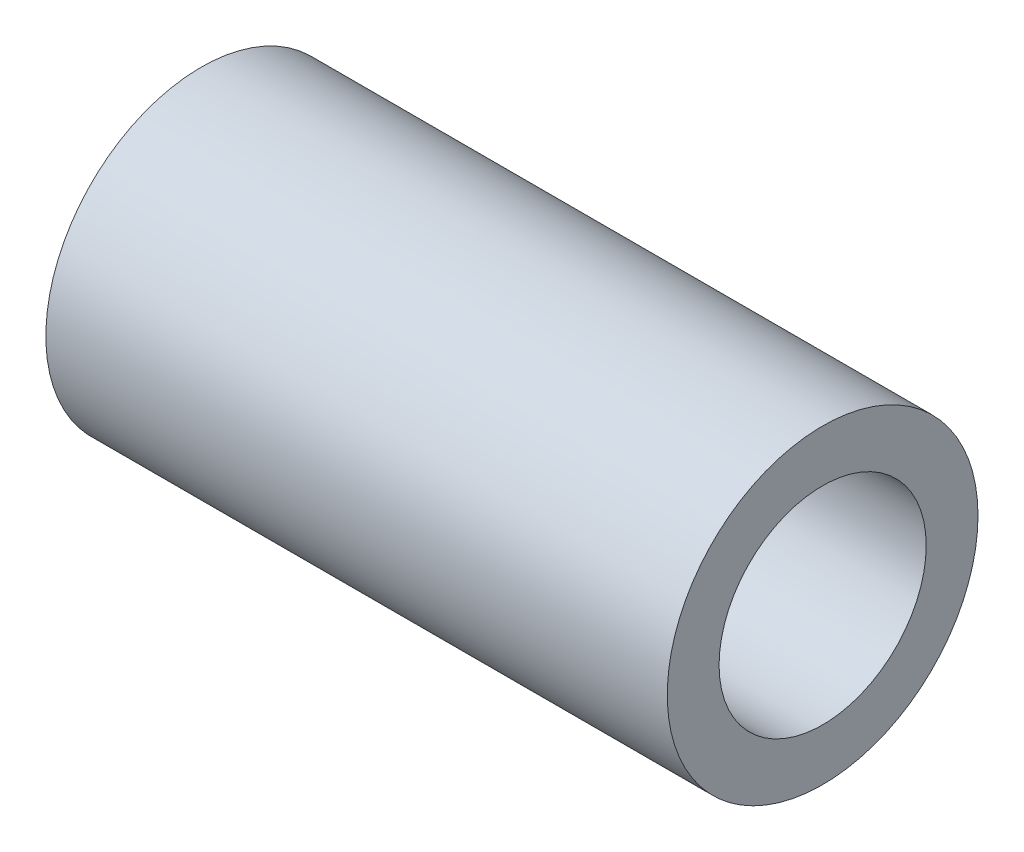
from build123d import *

# Parameters (mm, degrees)
SKETCH1_R           = 3
SKETCH1_R_2         = 2
BOSS_EXTRUDE1_DEPTH = 12


with BuildPart() as part:
    # Sketch1 → Boss-Extrude1 (new body)
    with BuildSketch(Plane(origin=(0, 0, 0), x_dir=(0, 0, -1), z_dir=(1, 0, 0))):
        Circle(SKETCH1_R)
        Circle(SKETCH1_R_2, mode=Mode.SUBTRACT)
    extrude(amount=BOSS_EXTRUDE1_DEPTH)


solid = part.part
